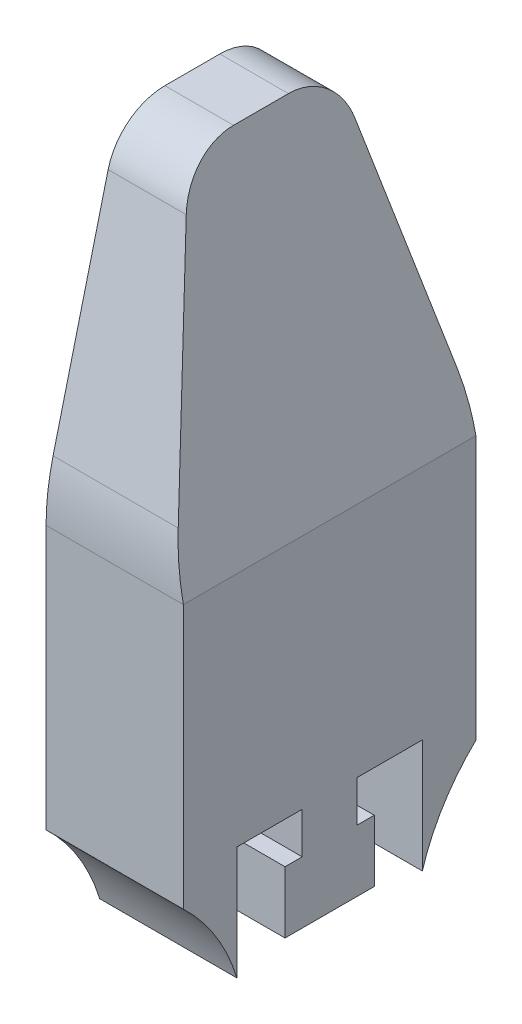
from build123d import *

# Parameters (mm, degrees)
BOSS_EXTRUDE1_DEPTH     = 20
CUT_EXTRUDE1_DEPTH      = 59.90962432
CUT_EXTRUDE1_DEPTH_BACK = 59.90962432


with BuildPart() as part:
    # Sketch1 → Boss-Extrude1 (new body)
    with BuildSketch(Plane(origin=(0, 0, 0), x_dir=(0, 0, -1), z_dir=(1, 0, 0))):
        with BuildLine():
            Line((-21.311801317, -34.098882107), (-21.311801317, 4.326956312))
            ThreePointArc((-21.311801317, 4.326956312), (-21.056317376, 8.493269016), (-20.29369395, 12.597149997))
            Line((-20.29369395, 12.597149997), (-12.270193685, 44.691151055))
            ThreePointArc((-12.270193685, 44.691151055), (-9.246217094, 49.342833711), (-4, 51.148323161))
            Line((-4, 51.148323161), (4, 51.148323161))
            ThreePointArc((4, 51.148323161), (9.246217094, 49.342833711), (12.270193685, 44.691151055))
            Line((12.270193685, 44.691151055), (20.29369395, 12.597149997))
            ThreePointArc((20.29369395, 12.597149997), (21.056317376, 8.493269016), (21.311801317, 4.326956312))
            Line((21.311801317, 4.326956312), (21.311801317, -34.098882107))
            ThreePointArc((21.311801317, -34.098882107), (16.594286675, -39.890058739), (13.5, -46.688445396))
            Line((13.5, -46.688445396), (13.5, -30.148323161))
            Line((13.5, -30.148323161), (4, -30.148323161))
            Line((4, -30.148323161), (4, -36.148323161))
            Line((4, -36.148323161), (6.5, -36.148323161))
            Line((6.5, -36.148323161), (6.5, -45.148323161))
            Line((6.5, -45.148323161), (-6.5, -45.148323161))
            Line((-6.5, -45.148323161), (-6.5, -36.148323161))
            Line((-6.5, -36.148323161), (-4, -36.148323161))
            Line((-4, -36.148323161), (-4, -30.148323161))
            Line((-4, -30.148323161), (-13.5, -30.148323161))
            Line((-13.5, -30.148323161), (-13.5, -46.688445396))
            ThreePointArc((-13.5, -46.688445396), (-16.594286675, -39.890058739), (-21.311801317, -34.098882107))
        make_face()
    extrude(amount=BOSS_EXTRUDE1_DEPTH)

    # Sketch2 → Cut-Extrude1 (cut, two sides: drawn at the far end of the back side and taken through both)
    with BuildSketch(Plane.XY.offset(-CUT_EXTRUDE1_DEPTH_BACK)):
        Polygon((10, 51.148323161), (20, 4.326956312), (20, 51.148323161), align=None)
    extrude(amount=CUT_EXTRUDE1_DEPTH + CUT_EXTRUDE1_DEPTH_BACK, mode=Mode.SUBTRACT)


solid = part.part
